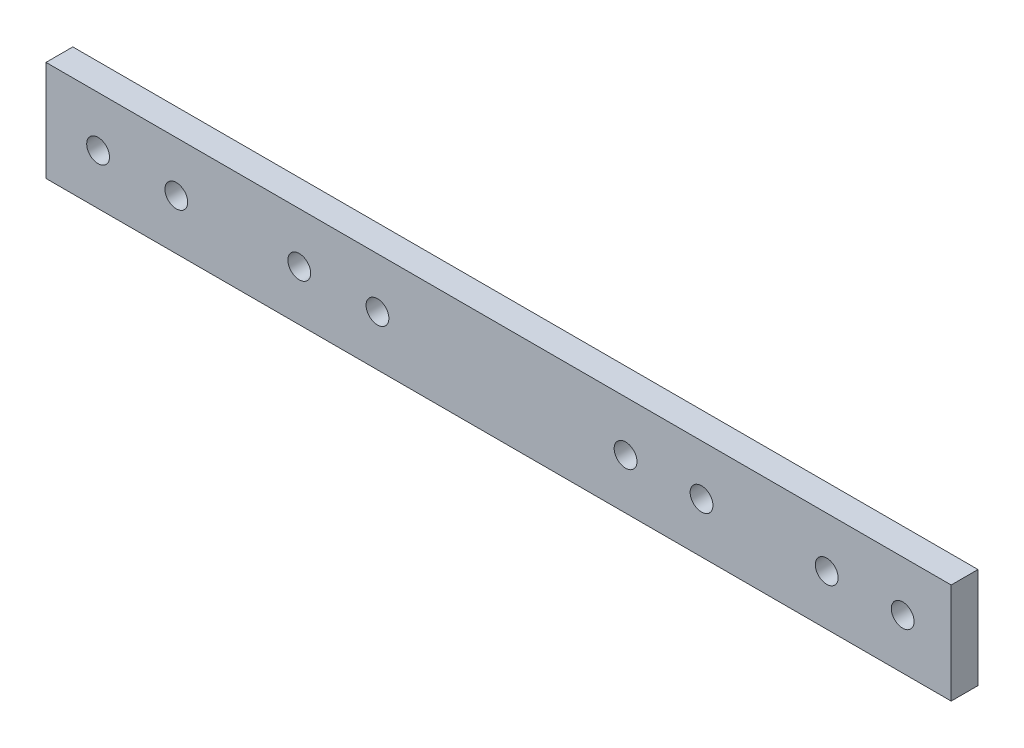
ISO-10303-21;
HEADER;
FILE_DESCRIPTION(('STEP AP214'),'2;1');
FILE_NAME('part.step','',(''),(''),'','','');
FILE_SCHEMA(('AUTOMOTIVE_DESIGN { 1 0 10303 214 1 1 1 1 }'));
ENDSEC;
DATA;
#1=APPLICATION_CONTEXT('core data for automotive mechanical design processes');
#2=APPLICATION_PROTOCOL_DEFINITION('international standard','automotive_design',2000,#1);
#3=PRODUCT_CONTEXT('',#1,'mechanical');
#4=PRODUCT('Part','Part','',(#3));
#5=PRODUCT_RELATED_PRODUCT_CATEGORY('part','',(#4));
#6=PRODUCT_DEFINITION_FORMATION('','',#4);
#7=PRODUCT_DEFINITION_CONTEXT('part definition',#1,'design');
#8=PRODUCT_DEFINITION('design','',#6,#7);
#9=PRODUCT_DEFINITION_SHAPE('','',#8);
#10=(LENGTH_UNIT() NAMED_UNIT(*) SI_UNIT(.MILLI.,.METRE.));
#11=(NAMED_UNIT(*) PLANE_ANGLE_UNIT() SI_UNIT($,.RADIAN.));
#12=(NAMED_UNIT(*) SI_UNIT($,.STERADIAN.) SOLID_ANGLE_UNIT());
#13=UNCERTAINTY_MEASURE_WITH_UNIT(LENGTH_MEASURE(1.E-05),#10,'distance_accuracy_value','');
#14=(GEOMETRIC_REPRESENTATION_CONTEXT(3) GLOBAL_UNCERTAINTY_ASSIGNED_CONTEXT((#13)) GLOBAL_UNIT_ASSIGNED_CONTEXT((#10,
#11,#12)) REPRESENTATION_CONTEXT('',''));
#15=CARTESIAN_POINT('',(0.,0.,0.));
#16=DIRECTION('',(0.,0.,1.));
#17=DIRECTION('',(1.,0.,0.));
#18=AXIS2_PLACEMENT_3D('',#15,#16,#17);
#19=CARTESIAN_POINT('',(135.,15.,8.));
#20=DIRECTION('',(-1.,0.,0.));
#21=DIRECTION('',(0.,0.,1.));
#22=AXIS2_PLACEMENT_3D('',#19,#20,#21);
#23=PLANE('',#22);
#24=DIRECTION('',(0.,1.,0.));
#25=VECTOR('',#24,1.);
#26=CARTESIAN_POINT('',(135.,15.,0.));
#27=LINE('',#26,#25);
#28=CARTESIAN_POINT('',(135.,-15.,0.));
#29=VERTEX_POINT('',#28);
#30=CARTESIAN_POINT('',(135.,15.,0.));
#31=VERTEX_POINT('',#30);
#32=EDGE_CURVE('E96',#29,#31,#27,.T.);
#33=ORIENTED_EDGE('',*,*,#32,.T.);
#34=DIRECTION('',(0.,0.,-1.));
#35=VECTOR('',#34,1.);
#36=CARTESIAN_POINT('',(135.,15.,8.));
#37=LINE('',#36,#35);
#38=CARTESIAN_POINT('',(135.,15.,8.));
#39=VERTEX_POINT('',#38);
#40=EDGE_CURVE('E11',#39,#31,#37,.T.);
#41=ORIENTED_EDGE('',*,*,#40,.F.);
#42=DIRECTION('',(0.,1.,0.));
#43=VECTOR('',#42,1.);
#44=CARTESIAN_POINT('',(135.,15.,8.));
#45=LINE('',#44,#43);
#46=CARTESIAN_POINT('',(135.,-15.,8.));
#47=VERTEX_POINT('',#46);
#48=EDGE_CURVE('E84',#47,#39,#45,.T.);
#49=ORIENTED_EDGE('',*,*,#48,.F.);
#50=DIRECTION('',(0.,0.,-1.));
#51=VECTOR('',#50,1.);
#52=CARTESIAN_POINT('',(135.,-15.,8.));
#53=LINE('',#52,#51);
#54=EDGE_CURVE('E92',#47,#29,#53,.T.);
#55=ORIENTED_EDGE('',*,*,#54,.T.);
#56=EDGE_LOOP('',(#33,#41,#49,#55));
#57=FACE_BOUND('',#56,.T.);
#58=ADVANCED_FACE('F33',(#57),#23,.F.);
#59=CARTESIAN_POINT('',(-135.,15.,8.));
#60=DIRECTION('',(0.,-1.,0.));
#61=DIRECTION('',(1.,0.,0.));
#62=AXIS2_PLACEMENT_3D('',#59,#60,#61);
#63=PLANE('',#62);
#64=DIRECTION('',(-1.,0.,0.));
#65=VECTOR('',#64,1.);
#66=CARTESIAN_POINT('',(-135.,15.,0.));
#67=LINE('',#66,#65);
#68=CARTESIAN_POINT('',(-135.,15.,0.));
#69=VERTEX_POINT('',#68);
#70=EDGE_CURVE('E88',#31,#69,#67,.T.);
#71=ORIENTED_EDGE('',*,*,#70,.T.);
#72=DIRECTION('',(0.,0.,-1.));
#73=VECTOR('',#72,1.);
#74=CARTESIAN_POINT('',(-135.,15.,8.));
#75=LINE('',#74,#73);
#76=CARTESIAN_POINT('',(-135.,15.,8.));
#77=VERTEX_POINT('',#76);
#78=EDGE_CURVE('E41',#77,#69,#75,.T.);
#79=ORIENTED_EDGE('',*,*,#78,.F.);
#80=DIRECTION('',(-1.,0.,0.));
#81=VECTOR('',#80,1.);
#82=CARTESIAN_POINT('',(-135.,15.,8.));
#83=LINE('',#82,#81);
#84=EDGE_CURVE('E79',#39,#77,#83,.T.);
#85=ORIENTED_EDGE('',*,*,#84,.F.);
#86=ORIENTED_EDGE('',*,*,#40,.T.);
#87=EDGE_LOOP('',(#71,#79,#85,#86));
#88=FACE_BOUND('',#87,.T.);
#89=ADVANCED_FACE('F87',(#88),#63,.F.);
#90=CARTESIAN_POINT('',(-135.,15.,8.));
#91=DIRECTION('',(1.,0.,0.));
#92=DIRECTION('',(0.,1.,0.));
#93=AXIS2_PLACEMENT_3D('',#90,#91,#92);
#94=PLANE('',#93);
#95=DIRECTION('',(0.,-1.,0.));
#96=VECTOR('',#95,1.);
#97=CARTESIAN_POINT('',(-135.,15.,0.));
#98=LINE('',#97,#96);
#99=CARTESIAN_POINT('',(-135.,-15.,0.));
#100=VERTEX_POINT('',#99);
#101=EDGE_CURVE('E66',#69,#100,#98,.T.);
#102=ORIENTED_EDGE('',*,*,#101,.T.);
#103=DIRECTION('',(0.,0.,-1.));
#104=VECTOR('',#103,1.);
#105=CARTESIAN_POINT('',(-135.,-15.,8.));
#106=LINE('',#105,#104);
#107=CARTESIAN_POINT('',(-135.,-15.,8.));
#108=VERTEX_POINT('',#107);
#109=EDGE_CURVE('E89',#108,#100,#106,.T.);
#110=ORIENTED_EDGE('',*,*,#109,.F.);
#111=DIRECTION('',(0.,-1.,0.));
#112=VECTOR('',#111,1.);
#113=CARTESIAN_POINT('',(-135.,15.,8.));
#114=LINE('',#113,#112);
#115=EDGE_CURVE('E82',#77,#108,#114,.T.);
#116=ORIENTED_EDGE('',*,*,#115,.F.);
#117=ORIENTED_EDGE('',*,*,#78,.T.);
#118=EDGE_LOOP('',(#102,#110,#116,#117));
#119=FACE_BOUND('',#118,.T.);
#120=ADVANCED_FACE('F90',(#119),#94,.F.);
#121=CARTESIAN_POINT('',(-135.,-15.,8.));
#122=DIRECTION('',(0.,1.,0.));
#123=DIRECTION('',(0.,0.,1.));
#124=AXIS2_PLACEMENT_3D('',#121,#122,#123);
#125=PLANE('',#124);
#126=DIRECTION('',(1.,0.,0.));
#127=VECTOR('',#126,1.);
#128=CARTESIAN_POINT('',(-135.,-15.,0.));
#129=LINE('',#128,#127);
#130=EDGE_CURVE('E72',#100,#29,#129,.T.);
#131=ORIENTED_EDGE('',*,*,#130,.T.);
#132=ORIENTED_EDGE('',*,*,#54,.F.);
#133=DIRECTION('',(1.,0.,0.));
#134=VECTOR('',#133,1.);
#135=CARTESIAN_POINT('',(-135.,-15.,8.));
#136=LINE('',#135,#134);
#137=EDGE_CURVE('E49',#108,#47,#136,.T.);
#138=ORIENTED_EDGE('',*,*,#137,.F.);
#139=ORIENTED_EDGE('',*,*,#109,.T.);
#140=EDGE_LOOP('',(#131,#132,#138,#139));
#141=FACE_BOUND('',#140,.T.);
#142=ADVANCED_FACE('F104',(#141),#125,.F.);
#143=CARTESIAN_POINT('',(135.,-15.,8.));
#144=DIRECTION('',(0.,0.,1.));
#145=DIRECTION('',(1.,0.,0.));
#146=AXIS2_PLACEMENT_3D('',#143,#144,#145);
#147=PLANE('',#146);
#148=CARTESIAN_POINT('',(-119.464274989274,0.,8.));
#149=DIRECTION('',(0.,0.,1.));
#150=DIRECTION('',(1.,0.,0.));
#151=AXIS2_PLACEMENT_3D('',#148,#149,#150);
#152=CIRCLE('',#151,3.39999999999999);
#153=CARTESIAN_POINT('',(-116.064274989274,0.,8.));
#154=VERTEX_POINT('',#153);
#155=EDGE_CURVE('E154',#154,#154,#152,.T.);
#156=ORIENTED_EDGE('',*,*,#155,.F.);
#157=EDGE_LOOP('',(#156));
#158=FACE_BOUND('',#157,.T.);
#159=CARTESIAN_POINT('',(-96.1247837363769,0.,8.));
#160=DIRECTION('',(0.,0.,1.));
#161=DIRECTION('',(1.,0.,0.));
#162=AXIS2_PLACEMENT_3D('',#159,#160,#161);
#163=CIRCLE('',#162,3.39999999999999);
#164=CARTESIAN_POINT('',(-92.7247837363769,0.,8.));
#165=VERTEX_POINT('',#164);
#166=EDGE_CURVE('E148',#165,#165,#163,.T.);
#167=ORIENTED_EDGE('',*,*,#166,.F.);
#168=EDGE_LOOP('',(#167));
#169=FACE_BOUND('',#168,.T.);
#170=CARTESIAN_POINT('',(-59.464274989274,0.,8.));
#171=DIRECTION('',(0.,0.,1.));
#172=DIRECTION('',(1.,0.,0.));
#173=AXIS2_PLACEMENT_3D('',#170,#171,#172);
#174=CIRCLE('',#173,3.39999999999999);
#175=CARTESIAN_POINT('',(-56.064274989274,0.,8.));
#176=VERTEX_POINT('',#175);
#177=EDGE_CURVE('E142',#176,#176,#174,.T.);
#178=ORIENTED_EDGE('',*,*,#177,.F.);
#179=EDGE_LOOP('',(#178));
#180=FACE_BOUND('',#179,.T.);
#181=CARTESIAN_POINT('',(-36.1247837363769,0.,8.));
#182=DIRECTION('',(0.,0.,1.));
#183=DIRECTION('',(1.,0.,0.));
#184=AXIS2_PLACEMENT_3D('',#181,#182,#183);
#185=CIRCLE('',#184,3.39999999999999);
#186=CARTESIAN_POINT('',(-32.7247837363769,0.,8.));
#187=VERTEX_POINT('',#186);
#188=EDGE_CURVE('E136',#187,#187,#185,.T.);
#189=ORIENTED_EDGE('',*,*,#188,.F.);
#190=EDGE_LOOP('',(#189));
#191=FACE_BOUND('',#190,.T.);
#192=CARTESIAN_POINT('',(37.8752162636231,0.,8.));
#193=DIRECTION('',(0.,0.,1.));
#194=DIRECTION('',(1.,0.,0.));
#195=AXIS2_PLACEMENT_3D('',#192,#193,#194);
#196=CIRCLE('',#195,3.39999999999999);
#197=CARTESIAN_POINT('',(41.2752162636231,0.,8.));
#198=VERTEX_POINT('',#197);
#199=EDGE_CURVE('E130',#198,#198,#196,.T.);
#200=ORIENTED_EDGE('',*,*,#199,.F.);
#201=EDGE_LOOP('',(#200));
#202=FACE_BOUND('',#201,.T.);
#203=CARTESIAN_POINT('',(60.535725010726,0.,8.));
#204=DIRECTION('',(0.,0.,1.));
#205=DIRECTION('',(1.,0.,0.));
#206=AXIS2_PLACEMENT_3D('',#203,#204,#205);
#207=CIRCLE('',#206,3.39999999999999);
#208=CARTESIAN_POINT('',(63.935725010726,0.,8.));
#209=VERTEX_POINT('',#208);
#210=EDGE_CURVE('E124',#209,#209,#207,.T.);
#211=ORIENTED_EDGE('',*,*,#210,.F.);
#212=EDGE_LOOP('',(#211));
#213=FACE_BOUND('',#212,.T.);
#214=CARTESIAN_POINT('',(97.8752162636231,0.,8.));
#215=DIRECTION('',(0.,0.,1.));
#216=DIRECTION('',(1.,0.,0.));
#217=AXIS2_PLACEMENT_3D('',#214,#215,#216);
#218=CIRCLE('',#217,3.39999999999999);
#219=CARTESIAN_POINT('',(101.275216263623,0.,8.));
#220=VERTEX_POINT('',#219);
#221=EDGE_CURVE('E118',#220,#220,#218,.T.);
#222=ORIENTED_EDGE('',*,*,#221,.F.);
#223=EDGE_LOOP('',(#222));
#224=FACE_BOUND('',#223,.T.);
#225=CARTESIAN_POINT('',(120.535725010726,0.,8.));
#226=DIRECTION('',(0.,0.,1.));
#227=DIRECTION('',(1.,0.,0.));
#228=AXIS2_PLACEMENT_3D('',#225,#226,#227);
#229=CIRCLE('',#228,3.39999999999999);
#230=CARTESIAN_POINT('',(123.935725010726,0.,8.));
#231=VERTEX_POINT('',#230);
#232=EDGE_CURVE('E112',#231,#231,#229,.T.);
#233=ORIENTED_EDGE('',*,*,#232,.F.);
#234=EDGE_LOOP('',(#233));
#235=FACE_BOUND('',#234,.T.);
#236=ORIENTED_EDGE('',*,*,#48,.T.);
#237=ORIENTED_EDGE('',*,*,#84,.T.);
#238=ORIENTED_EDGE('',*,*,#115,.T.);
#239=ORIENTED_EDGE('',*,*,#137,.T.);
#240=EDGE_LOOP('',(#236,#237,#238,#239));
#241=FACE_BOUND('',#240,.T.);
#242=ADVANCED_FACE('F80',(#158,#169,#180,#191,#202,#213,#224,#235,#241),#147,.T.);
#243=CARTESIAN_POINT('',(135.,-15.,0.));
#244=DIRECTION('',(0.,0.,1.));
#245=DIRECTION('',(1.,0.,0.));
#246=AXIS2_PLACEMENT_3D('',#243,#244,#245);
#247=PLANE('',#246);
#248=CARTESIAN_POINT('',(-119.464274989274,0.,0.));
#249=DIRECTION('',(0.,0.,1.));
#250=DIRECTION('',(1.,0.,0.));
#251=AXIS2_PLACEMENT_3D('',#248,#249,#250);
#252=CIRCLE('',#251,3.4);
#253=CARTESIAN_POINT('',(-116.064274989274,0.,0.));
#254=VERTEX_POINT('',#253);
#255=EDGE_CURVE('E151',#254,#254,#252,.T.);
#256=ORIENTED_EDGE('',*,*,#255,.T.);
#257=EDGE_LOOP('',(#256));
#258=FACE_BOUND('',#257,.T.);
#259=CARTESIAN_POINT('',(-96.1247837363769,0.,0.));
#260=DIRECTION('',(0.,0.,1.));
#261=DIRECTION('',(1.,0.,0.));
#262=AXIS2_PLACEMENT_3D('',#259,#260,#261);
#263=CIRCLE('',#262,3.4);
#264=CARTESIAN_POINT('',(-92.7247837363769,0.,0.));
#265=VERTEX_POINT('',#264);
#266=EDGE_CURVE('E145',#265,#265,#263,.T.);
#267=ORIENTED_EDGE('',*,*,#266,.T.);
#268=EDGE_LOOP('',(#267));
#269=FACE_BOUND('',#268,.T.);
#270=CARTESIAN_POINT('',(-59.464274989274,0.,0.));
#271=DIRECTION('',(0.,0.,1.));
#272=DIRECTION('',(1.,0.,0.));
#273=AXIS2_PLACEMENT_3D('',#270,#271,#272);
#274=CIRCLE('',#273,3.39999999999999);
#275=CARTESIAN_POINT('',(-56.064274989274,0.,0.));
#276=VERTEX_POINT('',#275);
#277=EDGE_CURVE('E139',#276,#276,#274,.T.);
#278=ORIENTED_EDGE('',*,*,#277,.T.);
#279=EDGE_LOOP('',(#278));
#280=FACE_BOUND('',#279,.T.);
#281=CARTESIAN_POINT('',(-36.1247837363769,0.,0.));
#282=DIRECTION('',(0.,0.,1.));
#283=DIRECTION('',(1.,0.,0.));
#284=AXIS2_PLACEMENT_3D('',#281,#282,#283);
#285=CIRCLE('',#284,3.39999999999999);
#286=CARTESIAN_POINT('',(-32.7247837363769,0.,0.));
#287=VERTEX_POINT('',#286);
#288=EDGE_CURVE('E133',#287,#287,#285,.T.);
#289=ORIENTED_EDGE('',*,*,#288,.T.);
#290=EDGE_LOOP('',(#289));
#291=FACE_BOUND('',#290,.T.);
#292=CARTESIAN_POINT('',(37.8752162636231,0.,0.));
#293=DIRECTION('',(0.,0.,1.));
#294=DIRECTION('',(1.,0.,0.));
#295=AXIS2_PLACEMENT_3D('',#292,#293,#294);
#296=CIRCLE('',#295,3.39999999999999);
#297=CARTESIAN_POINT('',(41.2752162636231,0.,0.));
#298=VERTEX_POINT('',#297);
#299=EDGE_CURVE('E127',#298,#298,#296,.T.);
#300=ORIENTED_EDGE('',*,*,#299,.T.);
#301=EDGE_LOOP('',(#300));
#302=FACE_BOUND('',#301,.T.);
#303=CARTESIAN_POINT('',(60.535725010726,0.,0.));
#304=DIRECTION('',(0.,0.,1.));
#305=DIRECTION('',(1.,0.,0.));
#306=AXIS2_PLACEMENT_3D('',#303,#304,#305);
#307=CIRCLE('',#306,3.4);
#308=CARTESIAN_POINT('',(63.935725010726,0.,0.));
#309=VERTEX_POINT('',#308);
#310=EDGE_CURVE('E121',#309,#309,#307,.T.);
#311=ORIENTED_EDGE('',*,*,#310,.T.);
#312=EDGE_LOOP('',(#311));
#313=FACE_BOUND('',#312,.T.);
#314=CARTESIAN_POINT('',(97.8752162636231,0.,0.));
#315=DIRECTION('',(0.,0.,1.));
#316=DIRECTION('',(1.,0.,0.));
#317=AXIS2_PLACEMENT_3D('',#314,#315,#316);
#318=CIRCLE('',#317,3.4);
#319=CARTESIAN_POINT('',(101.275216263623,0.,0.));
#320=VERTEX_POINT('',#319);
#321=EDGE_CURVE('E115',#320,#320,#318,.T.);
#322=ORIENTED_EDGE('',*,*,#321,.T.);
#323=EDGE_LOOP('',(#322));
#324=FACE_BOUND('',#323,.T.);
#325=CARTESIAN_POINT('',(120.535725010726,0.,0.));
#326=DIRECTION('',(0.,0.,1.));
#327=DIRECTION('',(1.,0.,0.));
#328=AXIS2_PLACEMENT_3D('',#325,#326,#327);
#329=CIRCLE('',#328,3.4);
#330=CARTESIAN_POINT('',(123.935725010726,0.,0.));
#331=VERTEX_POINT('',#330);
#332=EDGE_CURVE('E99',#331,#331,#329,.T.);
#333=ORIENTED_EDGE('',*,*,#332,.T.);
#334=EDGE_LOOP('',(#333));
#335=FACE_BOUND('',#334,.T.);
#336=ORIENTED_EDGE('',*,*,#32,.F.);
#337=ORIENTED_EDGE('',*,*,#130,.F.);
#338=ORIENTED_EDGE('',*,*,#101,.F.);
#339=ORIENTED_EDGE('',*,*,#70,.F.);
#340=EDGE_LOOP('',(#336,#337,#338,#339));
#341=FACE_BOUND('',#340,.T.);
#342=ADVANCED_FACE('F107',(#258,#269,#280,#291,#302,#313,#324,#335,#341),#247,.F.);
#343=CARTESIAN_POINT('',(120.535725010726,0.,8.));
#344=DIRECTION('',(0.,0.,1.));
#345=DIRECTION('',(1.,0.,0.));
#346=AXIS2_PLACEMENT_3D('',#343,#344,#345);
#347=CYLINDRICAL_SURFACE('',#346,3.39999999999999);
#348=ORIENTED_EDGE('',*,*,#332,.F.);
#349=EDGE_LOOP('',(#348));
#350=FACE_BOUND('',#349,.T.);
#351=ORIENTED_EDGE('',*,*,#232,.T.);
#352=EDGE_LOOP('',(#351));
#353=FACE_BOUND('',#352,.T.);
#354=ADVANCED_FACE('F177',(#350,#353),#347,.F.);
#355=CARTESIAN_POINT('',(97.8752162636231,0.,8.));
#356=DIRECTION('',(0.,0.,1.));
#357=DIRECTION('',(1.,0.,0.));
#358=AXIS2_PLACEMENT_3D('',#355,#356,#357);
#359=CYLINDRICAL_SURFACE('',#358,3.39999999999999);
#360=ORIENTED_EDGE('',*,*,#321,.F.);
#361=EDGE_LOOP('',(#360));
#362=FACE_BOUND('',#361,.T.);
#363=ORIENTED_EDGE('',*,*,#221,.T.);
#364=EDGE_LOOP('',(#363));
#365=FACE_BOUND('',#364,.T.);
#366=ADVANCED_FACE('F179',(#362,#365),#359,.F.);
#367=CARTESIAN_POINT('',(60.535725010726,0.,8.));
#368=DIRECTION('',(0.,0.,1.));
#369=DIRECTION('',(1.,0.,0.));
#370=AXIS2_PLACEMENT_3D('',#367,#368,#369);
#371=CYLINDRICAL_SURFACE('',#370,3.39999999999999);
#372=ORIENTED_EDGE('',*,*,#310,.F.);
#373=EDGE_LOOP('',(#372));
#374=FACE_BOUND('',#373,.T.);
#375=ORIENTED_EDGE('',*,*,#210,.T.);
#376=EDGE_LOOP('',(#375));
#377=FACE_BOUND('',#376,.T.);
#378=ADVANCED_FACE('F186',(#374,#377),#371,.F.);
#379=CARTESIAN_POINT('',(37.8752162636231,0.,8.));
#380=DIRECTION('',(0.,0.,1.));
#381=DIRECTION('',(1.,0.,0.));
#382=AXIS2_PLACEMENT_3D('',#379,#380,#381);
#383=CYLINDRICAL_SURFACE('',#382,3.39999999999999);
#384=ORIENTED_EDGE('',*,*,#299,.F.);
#385=EDGE_LOOP('',(#384));
#386=FACE_BOUND('',#385,.T.);
#387=ORIENTED_EDGE('',*,*,#199,.T.);
#388=EDGE_LOOP('',(#387));
#389=FACE_BOUND('',#388,.T.);
#390=ADVANCED_FACE('F233',(#386,#389),#383,.F.);
#391=CARTESIAN_POINT('',(-36.1247837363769,0.,8.));
#392=DIRECTION('',(0.,0.,1.));
#393=DIRECTION('',(1.,0.,0.));
#394=AXIS2_PLACEMENT_3D('',#391,#392,#393);
#395=CYLINDRICAL_SURFACE('',#394,3.39999999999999);
#396=ORIENTED_EDGE('',*,*,#288,.F.);
#397=EDGE_LOOP('',(#396));
#398=FACE_BOUND('',#397,.T.);
#399=ORIENTED_EDGE('',*,*,#188,.T.);
#400=EDGE_LOOP('',(#399));
#401=FACE_BOUND('',#400,.T.);
#402=ADVANCED_FACE('F243',(#398,#401),#395,.F.);
#403=CARTESIAN_POINT('',(-59.464274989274,0.,8.));
#404=DIRECTION('',(0.,0.,1.));
#405=DIRECTION('',(1.,0.,0.));
#406=AXIS2_PLACEMENT_3D('',#403,#404,#405);
#407=CYLINDRICAL_SURFACE('',#406,3.39999999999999);
#408=ORIENTED_EDGE('',*,*,#277,.F.);
#409=EDGE_LOOP('',(#408));
#410=FACE_BOUND('',#409,.T.);
#411=ORIENTED_EDGE('',*,*,#177,.T.);
#412=EDGE_LOOP('',(#411));
#413=FACE_BOUND('',#412,.T.);
#414=ADVANCED_FACE('F253',(#410,#413),#407,.F.);
#415=CARTESIAN_POINT('',(-96.1247837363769,0.,8.));
#416=DIRECTION('',(0.,0.,1.));
#417=DIRECTION('',(1.,0.,0.));
#418=AXIS2_PLACEMENT_3D('',#415,#416,#417);
#419=CYLINDRICAL_SURFACE('',#418,3.39999999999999);
#420=ORIENTED_EDGE('',*,*,#266,.F.);
#421=EDGE_LOOP('',(#420));
#422=FACE_BOUND('',#421,.T.);
#423=ORIENTED_EDGE('',*,*,#166,.T.);
#424=EDGE_LOOP('',(#423));
#425=FACE_BOUND('',#424,.T.);
#426=ADVANCED_FACE('F263',(#422,#425),#419,.F.);
#427=CARTESIAN_POINT('',(-119.464274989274,0.,8.));
#428=DIRECTION('',(0.,0.,1.));
#429=DIRECTION('',(1.,0.,0.));
#430=AXIS2_PLACEMENT_3D('',#427,#428,#429);
#431=CYLINDRICAL_SURFACE('',#430,3.39999999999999);
#432=ORIENTED_EDGE('',*,*,#255,.F.);
#433=EDGE_LOOP('',(#432));
#434=FACE_BOUND('',#433,.T.);
#435=ORIENTED_EDGE('',*,*,#155,.T.);
#436=EDGE_LOOP('',(#435));
#437=FACE_BOUND('',#436,.T.);
#438=ADVANCED_FACE('F158',(#434,#437),#431,.F.);
#439=CLOSED_SHELL('',(#58,#89,#120,#142,#242,#342,#354,#366,#378,#390,#402,#414,#426,#438));
#440=MANIFOLD_SOLID_BREP('B2',#439);
#441=ADVANCED_BREP_SHAPE_REPRESENTATION('',(#18,#440),#14);
#442=SHAPE_DEFINITION_REPRESENTATION(#9,#441);
ENDSEC;
END-ISO-10303-21;
